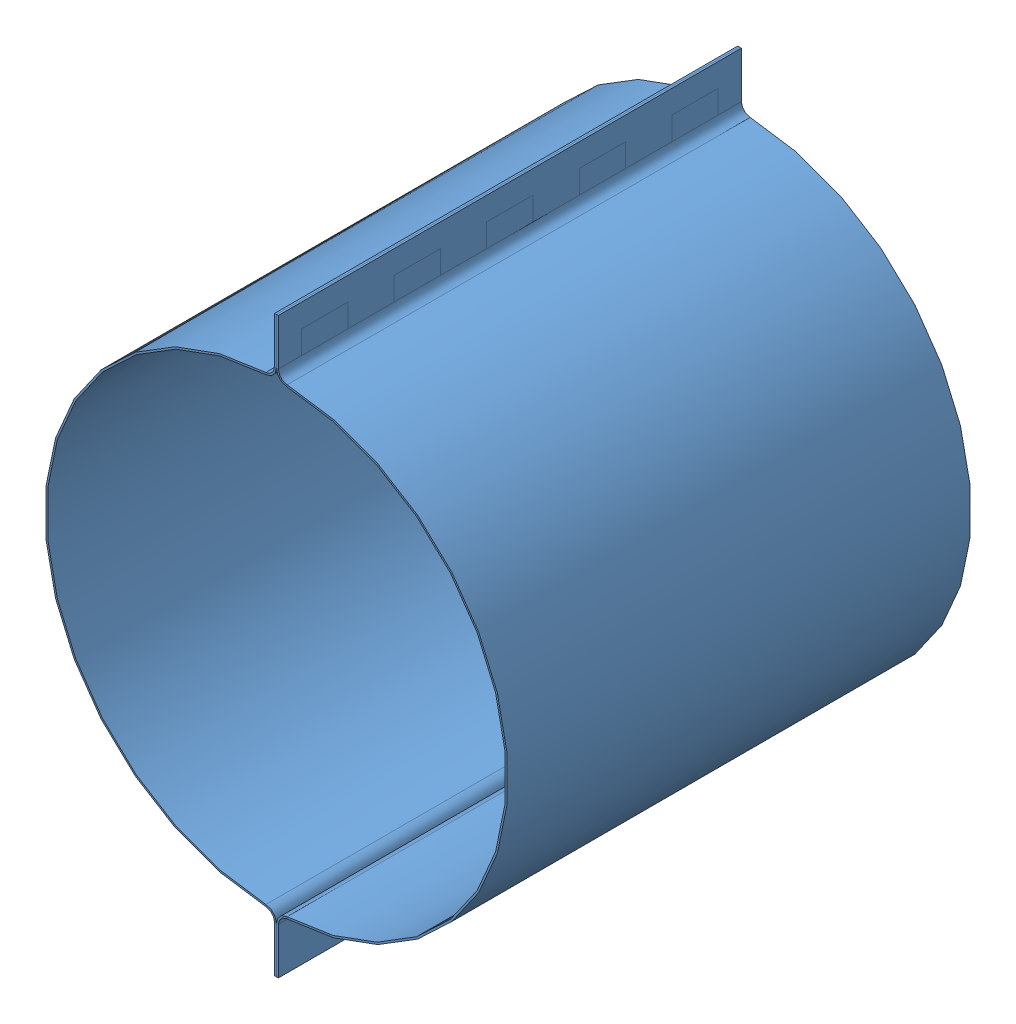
SolidWorks assembly tube solid.SLDASM, configuration complete tube (file format 14000). Lengths in mm.
Overall size (254 314.68 254).
2 component instances, 1 part files, 3 mates.
Components (placement in the parent):
- tube 30-1: tube 30.SLDPRT [Default] at (17.4888 68.4375 -55.724) size (127 314.68 254)
- tube 30-2: tube 30.SLDPRT [Default] at (17.4888 68.4375 -55.724) x (-1 0 0) z (0 0 1) size (127 314.68 254)
Mates (geometry in assembly coordinates):
- Coincident1: coincident anti-aligned: plane of tube 30-2 through (17.4888 225.7767 198.276) normal (-1 0 0); plane of tube 30-1 through (17.4888 225.7767 198.276) normal (1 0 0)
- Coincident2: coincident aligned: plane of tube 30-2 through (17.4888 225.7767 198.276) normal (0 1 0); plane of tube 30-1 through (16.4728 225.7767 198.276) normal (0 1 0)
- Coincident3: coincident aligned: plane of tube 30-1 through (11.6272 195.3021 198.276) normal (0 0 1); plane of tube 30-2 through (23.3503 -58.4272 198.276) normal (0 0 1)
